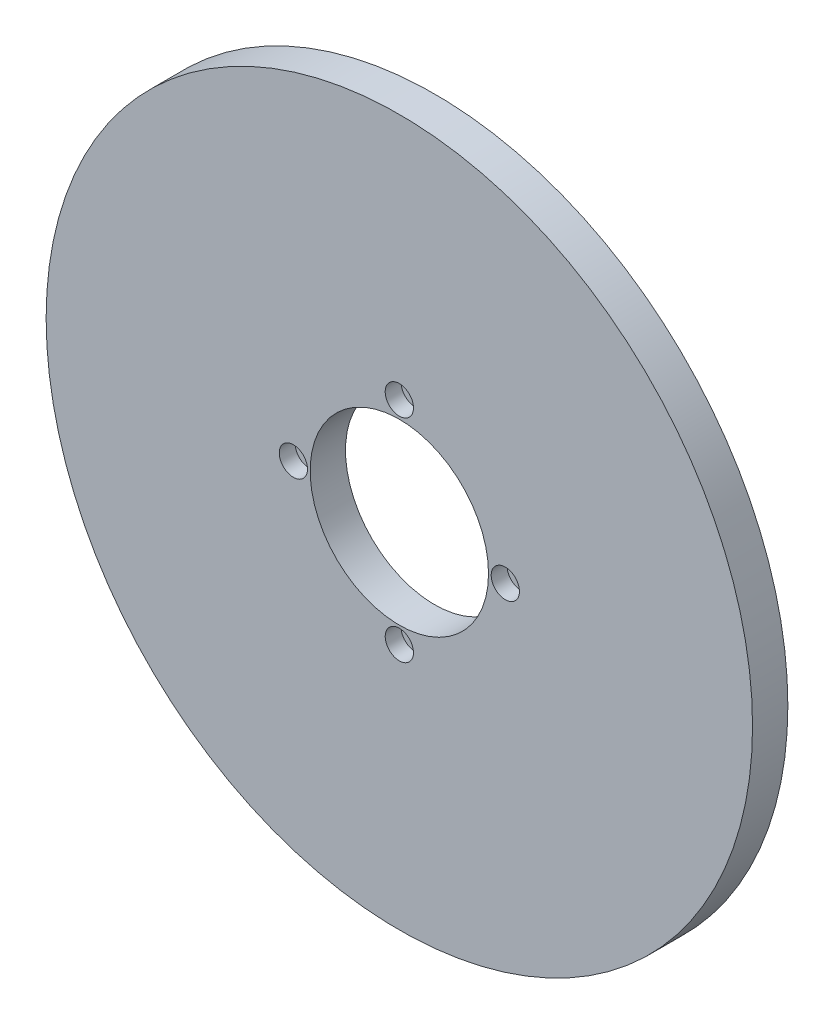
ISO-10303-21;
HEADER;
FILE_DESCRIPTION(('STEP AP214'),'2;1');
FILE_NAME('part.step','',(''),(''),'','','');
FILE_SCHEMA(('AUTOMOTIVE_DESIGN { 1 0 10303 214 1 1 1 1 }'));
ENDSEC;
DATA;
#1=APPLICATION_CONTEXT('core data for automotive mechanical design processes');
#2=APPLICATION_PROTOCOL_DEFINITION('international standard','automotive_design',2000,#1);
#3=PRODUCT_CONTEXT('',#1,'mechanical');
#4=PRODUCT('Part','Part','',(#3));
#5=PRODUCT_RELATED_PRODUCT_CATEGORY('part','',(#4));
#6=PRODUCT_DEFINITION_FORMATION('','',#4);
#7=PRODUCT_DEFINITION_CONTEXT('part definition',#1,'design');
#8=PRODUCT_DEFINITION('design','',#6,#7);
#9=PRODUCT_DEFINITION_SHAPE('','',#8);
#10=(LENGTH_UNIT() NAMED_UNIT(*) SI_UNIT(.MILLI.,.METRE.));
#11=(NAMED_UNIT(*) PLANE_ANGLE_UNIT() SI_UNIT($,.RADIAN.));
#12=(NAMED_UNIT(*) SI_UNIT($,.STERADIAN.) SOLID_ANGLE_UNIT());
#13=UNCERTAINTY_MEASURE_WITH_UNIT(LENGTH_MEASURE(1.E-05),#10,'distance_accuracy_value','');
#14=(GEOMETRIC_REPRESENTATION_CONTEXT(3) GLOBAL_UNCERTAINTY_ASSIGNED_CONTEXT((#13)) GLOBAL_UNIT_ASSIGNED_CONTEXT((#10,
#11,#12)) REPRESENTATION_CONTEXT('',''));
#15=CARTESIAN_POINT('',(0.,0.,0.));
#16=DIRECTION('',(0.,0.,1.));
#17=DIRECTION('',(1.,0.,0.));
#18=AXIS2_PLACEMENT_3D('',#15,#16,#17);
#19=CARTESIAN_POINT('',(0.,-29.9999999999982,10.));
#20=DIRECTION('',(0.,0.,-1.));
#21=DIRECTION('',(-1.,0.,0.));
#22=AXIS2_PLACEMENT_3D('',#19,#20,#21);
#23=CYLINDRICAL_SURFACE('',#22,2.25);
#24=CARTESIAN_POINT('',(0.,-29.9999999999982,0.));
#25=DIRECTION('',(0.,0.,1.));
#26=DIRECTION('',(1.,0.,0.));
#27=AXIS2_PLACEMENT_3D('',#24,#25,#26);
#28=CIRCLE('',#27,2.25);
#29=CARTESIAN_POINT('',(2.25,-29.9999999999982,0.));
#30=VERTEX_POINT('',#29);
#31=EDGE_CURVE('E52',#30,#30,#28,.T.);
#32=ORIENTED_EDGE('',*,*,#31,.F.);
#33=EDGE_LOOP('',(#32));
#34=FACE_BOUND('',#33,.T.);
#35=CARTESIAN_POINT('',(0.,-29.9999999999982,5.5));
#36=DIRECTION('',(0.,0.,1.));
#37=DIRECTION('',(1.,0.,0.));
#38=AXIS2_PLACEMENT_3D('',#35,#36,#37);
#39=CIRCLE('',#38,2.25);
#40=CARTESIAN_POINT('',(2.25,-29.9999999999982,5.5));
#41=VERTEX_POINT('',#40);
#42=EDGE_CURVE('E34',#41,#41,#39,.T.);
#43=ORIENTED_EDGE('',*,*,#42,.T.);
#44=EDGE_LOOP('',(#43));
#45=FACE_BOUND('',#44,.T.);
#46=ADVANCED_FACE('F30',(#34,#45),#23,.F.);
#47=CARTESIAN_POINT('',(-30.,-9.09494701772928E-13,10.));
#48=DIRECTION('',(0.,0.,-1.));
#49=DIRECTION('',(-1.,0.,0.));
#50=AXIS2_PLACEMENT_3D('',#47,#48,#49);
#51=CYLINDRICAL_SURFACE('',#50,2.25);
#52=CARTESIAN_POINT('',(-30.,-9.09494701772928E-13,0.));
#53=DIRECTION('',(0.,0.,1.));
#54=DIRECTION('',(1.,0.,0.));
#55=AXIS2_PLACEMENT_3D('',#52,#53,#54);
#56=CIRCLE('',#55,2.25);
#57=CARTESIAN_POINT('',(-27.75,-9.09494701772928E-13,0.));
#58=VERTEX_POINT('',#57);
#59=EDGE_CURVE('E85',#58,#58,#56,.T.);
#60=ORIENTED_EDGE('',*,*,#59,.F.);
#61=EDGE_LOOP('',(#60));
#62=FACE_BOUND('',#61,.T.);
#63=CARTESIAN_POINT('',(-30.,-9.09494701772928E-13,5.5));
#64=DIRECTION('',(0.,0.,1.));
#65=DIRECTION('',(1.,0.,0.));
#66=AXIS2_PLACEMENT_3D('',#63,#64,#65);
#67=CIRCLE('',#66,2.25);
#68=CARTESIAN_POINT('',(-27.75,-9.09494701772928E-13,5.5));
#69=VERTEX_POINT('',#68);
#70=EDGE_CURVE('E58',#69,#69,#67,.T.);
#71=ORIENTED_EDGE('',*,*,#70,.T.);
#72=EDGE_LOOP('',(#71));
#73=FACE_BOUND('',#72,.T.);
#74=ADVANCED_FACE('F117',(#62,#73),#51,.F.);
#75=CARTESIAN_POINT('',(0.,29.9999999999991,10.));
#76=DIRECTION('',(0.,0.,-1.));
#77=DIRECTION('',(-1.,0.,0.));
#78=AXIS2_PLACEMENT_3D('',#75,#76,#77);
#79=CYLINDRICAL_SURFACE('',#78,2.25);
#80=CARTESIAN_POINT('',(0.,29.9999999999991,0.));
#81=DIRECTION('',(0.,0.,1.));
#82=DIRECTION('',(1.,0.,0.));
#83=AXIS2_PLACEMENT_3D('',#80,#81,#82);
#84=CIRCLE('',#83,2.25);
#85=CARTESIAN_POINT('',(2.25,29.9999999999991,0.));
#86=VERTEX_POINT('',#85);
#87=EDGE_CURVE('E88',#86,#86,#84,.T.);
#88=ORIENTED_EDGE('',*,*,#87,.F.);
#89=EDGE_LOOP('',(#88));
#90=FACE_BOUND('',#89,.T.);
#91=CARTESIAN_POINT('',(0.,29.9999999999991,5.5));
#92=DIRECTION('',(0.,0.,1.));
#93=DIRECTION('',(1.,0.,0.));
#94=AXIS2_PLACEMENT_3D('',#91,#92,#93);
#95=CIRCLE('',#94,2.25);
#96=CARTESIAN_POINT('',(2.25,29.9999999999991,5.5));
#97=VERTEX_POINT('',#96);
#98=EDGE_CURVE('E54',#97,#97,#95,.T.);
#99=ORIENTED_EDGE('',*,*,#98,.T.);
#100=EDGE_LOOP('',(#99));
#101=FACE_BOUND('',#100,.T.);
#102=ADVANCED_FACE('F123',(#90,#101),#79,.F.);
#103=CARTESIAN_POINT('',(30.,-9.09494701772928E-13,10.));
#104=DIRECTION('',(0.,0.,-1.));
#105=DIRECTION('',(-1.,0.,0.));
#106=AXIS2_PLACEMENT_3D('',#103,#104,#105);
#107=CYLINDRICAL_SURFACE('',#106,2.25);
#108=CARTESIAN_POINT('',(30.,-9.09494701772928E-13,0.));
#109=DIRECTION('',(0.,0.,1.));
#110=DIRECTION('',(1.,0.,0.));
#111=AXIS2_PLACEMENT_3D('',#108,#109,#110);
#112=CIRCLE('',#111,2.25);
#113=CARTESIAN_POINT('',(32.25,-9.09494701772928E-13,0.));
#114=VERTEX_POINT('',#113);
#115=EDGE_CURVE('E91',#114,#114,#112,.T.);
#116=ORIENTED_EDGE('',*,*,#115,.F.);
#117=EDGE_LOOP('',(#116));
#118=FACE_BOUND('',#117,.T.);
#119=CARTESIAN_POINT('',(30.,-9.09494701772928E-13,5.5));
#120=DIRECTION('',(0.,0.,1.));
#121=DIRECTION('',(1.,0.,0.));
#122=AXIS2_PLACEMENT_3D('',#119,#120,#121);
#123=CIRCLE('',#122,2.25);
#124=CARTESIAN_POINT('',(32.25,-9.09494701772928E-13,5.5));
#125=VERTEX_POINT('',#124);
#126=EDGE_CURVE('E49',#125,#125,#123,.T.);
#127=ORIENTED_EDGE('',*,*,#126,.T.);
#128=EDGE_LOOP('',(#127));
#129=FACE_BOUND('',#128,.T.);
#130=ADVANCED_FACE('F131',(#118,#129),#107,.F.);
#131=CARTESIAN_POINT('',(0.,-9.09494701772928E-13,10.));
#132=DIRECTION('',(0.,0.,1.));
#133=DIRECTION('',(1.,0.,0.));
#134=AXIS2_PLACEMENT_3D('',#131,#132,#133);
#135=PLANE('',#134);
#136=CARTESIAN_POINT('',(0.,-29.9999999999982,10.));
#137=DIRECTION('',(0.,0.,1.));
#138=DIRECTION('',(1.,0.,0.));
#139=AXIS2_PLACEMENT_3D('',#136,#137,#138);
#140=CIRCLE('',#139,4.);
#141=CARTESIAN_POINT('',(4.,-29.9999999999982,10.));
#142=VERTEX_POINT('',#141);
#143=EDGE_CURVE('E74',#142,#142,#140,.T.);
#144=ORIENTED_EDGE('',*,*,#143,.F.);
#145=EDGE_LOOP('',(#144));
#146=FACE_BOUND('',#145,.T.);
#147=CARTESIAN_POINT('',(-30.,-9.09494701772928E-13,10.));
#148=DIRECTION('',(0.,0.,1.));
#149=DIRECTION('',(1.,0.,0.));
#150=AXIS2_PLACEMENT_3D('',#147,#148,#149);
#151=CIRCLE('',#150,4.);
#152=CARTESIAN_POINT('',(-26.,-9.09494701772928E-13,10.));
#153=VERTEX_POINT('',#152);
#154=EDGE_CURVE('E67',#153,#153,#151,.T.);
#155=ORIENTED_EDGE('',*,*,#154,.F.);
#156=EDGE_LOOP('',(#155));
#157=FACE_BOUND('',#156,.T.);
#158=CARTESIAN_POINT('',(0.,29.9999999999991,10.));
#159=DIRECTION('',(0.,0.,1.));
#160=DIRECTION('',(1.,0.,0.));
#161=AXIS2_PLACEMENT_3D('',#158,#159,#160);
#162=CIRCLE('',#161,4.);
#163=CARTESIAN_POINT('',(4.,29.9999999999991,10.));
#164=VERTEX_POINT('',#163);
#165=EDGE_CURVE('E60',#164,#164,#162,.T.);
#166=ORIENTED_EDGE('',*,*,#165,.F.);
#167=EDGE_LOOP('',(#166));
#168=FACE_BOUND('',#167,.T.);
#169=CARTESIAN_POINT('',(30.,-9.09494701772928E-13,10.));
#170=DIRECTION('',(0.,0.,1.));
#171=DIRECTION('',(1.,0.,0.));
#172=AXIS2_PLACEMENT_3D('',#169,#170,#171);
#173=CIRCLE('',#172,4.);
#174=CARTESIAN_POINT('',(34.,-9.09494701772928E-13,10.));
#175=VERTEX_POINT('',#174);
#176=EDGE_CURVE('E56',#175,#175,#173,.T.);
#177=ORIENTED_EDGE('',*,*,#176,.F.);
#178=EDGE_LOOP('',(#177));
#179=FACE_BOUND('',#178,.T.);
#180=CARTESIAN_POINT('',(0.,-9.09494701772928E-13,10.));
#181=DIRECTION('',(0.,0.,1.));
#182=DIRECTION('',(1.,0.,0.));
#183=AXIS2_PLACEMENT_3D('',#180,#181,#182);
#184=CIRCLE('',#183,100.);
#185=CARTESIAN_POINT('',(100.,-9.09494701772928E-13,10.));
#186=VERTEX_POINT('',#185);
#187=EDGE_CURVE('E10',#186,#186,#184,.T.);
#188=ORIENTED_EDGE('',*,*,#187,.T.);
#189=EDGE_LOOP('',(#188));
#190=FACE_BOUND('',#189,.T.);
#191=CARTESIAN_POINT('',(0.,-9.09494701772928E-13,10.));
#192=DIRECTION('',(0.,0.,1.));
#193=DIRECTION('',(1.,0.,0.));
#194=AXIS2_PLACEMENT_3D('',#191,#192,#193);
#195=CIRCLE('',#194,25.2499999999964);
#196=CARTESIAN_POINT('',(25.2499999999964,-9.09494701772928E-13,10.));
#197=VERTEX_POINT('',#196);
#198=EDGE_CURVE('E43',#197,#197,#195,.T.);
#199=ORIENTED_EDGE('',*,*,#198,.F.);
#200=EDGE_LOOP('',(#199));
#201=FACE_BOUND('',#200,.T.);
#202=ADVANCED_FACE('F134',(#146,#157,#168,#179,#190,#201),#135,.T.);
#203=CARTESIAN_POINT('',(0.,-9.09494701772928E-13,0.));
#204=DIRECTION('',(0.,0.,1.));
#205=DIRECTION('',(1.,0.,0.));
#206=AXIS2_PLACEMENT_3D('',#203,#204,#205);
#207=PLANE('',#206);
#208=ORIENTED_EDGE('',*,*,#59,.T.);
#209=EDGE_LOOP('',(#208));
#210=FACE_BOUND('',#209,.T.);
#211=ORIENTED_EDGE('',*,*,#115,.T.);
#212=EDGE_LOOP('',(#211));
#213=FACE_BOUND('',#212,.T.);
#214=CARTESIAN_POINT('',(0.,-9.09494701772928E-13,0.));
#215=DIRECTION('',(0.,0.,1.));
#216=DIRECTION('',(1.,0.,0.));
#217=AXIS2_PLACEMENT_3D('',#214,#215,#216);
#218=CIRCLE('',#217,100.);
#219=CARTESIAN_POINT('',(100.,-9.09494701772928E-13,0.));
#220=VERTEX_POINT('',#219);
#221=EDGE_CURVE('E38',#220,#220,#218,.T.);
#222=ORIENTED_EDGE('',*,*,#221,.F.);
#223=EDGE_LOOP('',(#222));
#224=FACE_BOUND('',#223,.T.);
#225=CARTESIAN_POINT('',(0.,-9.09494701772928E-13,0.));
#226=DIRECTION('',(0.,0.,1.));
#227=DIRECTION('',(1.,0.,0.));
#228=AXIS2_PLACEMENT_3D('',#225,#226,#227);
#229=CIRCLE('',#228,25.2499999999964);
#230=CARTESIAN_POINT('',(25.2499999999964,-9.09494701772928E-13,0.));
#231=VERTEX_POINT('',#230);
#232=EDGE_CURVE('E46',#231,#231,#229,.T.);
#233=ORIENTED_EDGE('',*,*,#232,.T.);
#234=EDGE_LOOP('',(#233));
#235=FACE_BOUND('',#234,.T.);
#236=ORIENTED_EDGE('',*,*,#87,.T.);
#237=EDGE_LOOP('',(#236));
#238=FACE_BOUND('',#237,.T.);
#239=ORIENTED_EDGE('',*,*,#31,.T.);
#240=EDGE_LOOP('',(#239));
#241=FACE_BOUND('',#240,.T.);
#242=ADVANCED_FACE('F99',(#210,#213,#224,#235,#238,#241),#207,.F.);
#243=CARTESIAN_POINT('',(0.,-9.09494701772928E-13,10.));
#244=DIRECTION('',(0.,0.,-1.));
#245=DIRECTION('',(-1.,0.,0.));
#246=AXIS2_PLACEMENT_3D('',#243,#244,#245);
#247=CYLINDRICAL_SURFACE('',#246,100.);
#248=ORIENTED_EDGE('',*,*,#187,.F.);
#249=EDGE_LOOP('',(#248));
#250=FACE_BOUND('',#249,.T.);
#251=ORIENTED_EDGE('',*,*,#221,.T.);
#252=EDGE_LOOP('',(#251));
#253=FACE_BOUND('',#252,.T.);
#254=ADVANCED_FACE('F32',(#250,#253),#247,.T.);
#255=CARTESIAN_POINT('',(0.,-9.09494701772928E-13,10.));
#256=DIRECTION('',(0.,0.,-1.));
#257=DIRECTION('',(-1.,0.,0.));
#258=AXIS2_PLACEMENT_3D('',#255,#256,#257);
#259=CYLINDRICAL_SURFACE('',#258,25.2499999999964);
#260=ORIENTED_EDGE('',*,*,#198,.T.);
#261=EDGE_LOOP('',(#260));
#262=FACE_BOUND('',#261,.T.);
#263=ORIENTED_EDGE('',*,*,#232,.F.);
#264=EDGE_LOOP('',(#263));
#265=FACE_BOUND('',#264,.T.);
#266=ADVANCED_FACE('F102',(#262,#265),#259,.F.);
#267=CARTESIAN_POINT('',(30.,-9.09494701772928E-13,5.5));
#268=DIRECTION('',(0.,0.,1.));
#269=DIRECTION('',(1.,0.,0.));
#270=AXIS2_PLACEMENT_3D('',#267,#268,#269);
#271=CYLINDRICAL_SURFACE('',#270,4.);
#272=CARTESIAN_POINT('',(30.,-9.09494701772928E-13,5.5));
#273=DIRECTION('',(0.,0.,1.));
#274=DIRECTION('',(1.,0.,0.));
#275=AXIS2_PLACEMENT_3D('',#272,#273,#274);
#276=CIRCLE('',#275,4.);
#277=CARTESIAN_POINT('',(34.,-9.09494701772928E-13,5.5));
#278=VERTEX_POINT('',#277);
#279=EDGE_CURVE('E53',#278,#278,#276,.T.);
#280=ORIENTED_EDGE('',*,*,#279,.F.);
#281=EDGE_LOOP('',(#280));
#282=FACE_BOUND('',#281,.T.);
#283=ORIENTED_EDGE('',*,*,#176,.T.);
#284=EDGE_LOOP('',(#283));
#285=FACE_BOUND('',#284,.T.);
#286=ADVANCED_FACE('F104',(#282,#285),#271,.F.);
#287=CARTESIAN_POINT('',(30.,-9.09494701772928E-13,5.5));
#288=DIRECTION('',(0.,0.,1.));
#289=DIRECTION('',(1.,0.,0.));
#290=AXIS2_PLACEMENT_3D('',#287,#288,#289);
#291=PLANE('',#290);
#292=ORIENTED_EDGE('',*,*,#126,.F.);
#293=EDGE_LOOP('',(#292));
#294=FACE_BOUND('',#293,.T.);
#295=ORIENTED_EDGE('',*,*,#279,.T.);
#296=EDGE_LOOP('',(#295));
#297=FACE_BOUND('',#296,.T.);
#298=ADVANCED_FACE('F110',(#294,#297),#291,.T.);
#299=CARTESIAN_POINT('',(0.,29.9999999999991,5.5));
#300=DIRECTION('',(0.,0.,1.));
#301=DIRECTION('',(1.,0.,0.));
#302=AXIS2_PLACEMENT_3D('',#299,#300,#301);
#303=CYLINDRICAL_SURFACE('',#302,4.);
#304=CARTESIAN_POINT('',(0.,29.9999999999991,5.5));
#305=DIRECTION('',(0.,0.,1.));
#306=DIRECTION('',(1.,0.,0.));
#307=AXIS2_PLACEMENT_3D('',#304,#305,#306);
#308=CIRCLE('',#307,4.);
#309=CARTESIAN_POINT('',(4.,29.9999999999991,5.5));
#310=VERTEX_POINT('',#309);
#311=EDGE_CURVE('E57',#310,#310,#308,.T.);
#312=ORIENTED_EDGE('',*,*,#311,.F.);
#313=EDGE_LOOP('',(#312));
#314=FACE_BOUND('',#313,.T.);
#315=ORIENTED_EDGE('',*,*,#165,.T.);
#316=EDGE_LOOP('',(#315));
#317=FACE_BOUND('',#316,.T.);
#318=ADVANCED_FACE('F146',(#314,#317),#303,.F.);
#319=CARTESIAN_POINT('',(0.,29.9999999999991,5.5));
#320=DIRECTION('',(0.,0.,1.));
#321=DIRECTION('',(1.,0.,0.));
#322=AXIS2_PLACEMENT_3D('',#319,#320,#321);
#323=PLANE('',#322);
#324=ORIENTED_EDGE('',*,*,#98,.F.);
#325=EDGE_LOOP('',(#324));
#326=FACE_BOUND('',#325,.T.);
#327=ORIENTED_EDGE('',*,*,#311,.T.);
#328=EDGE_LOOP('',(#327));
#329=FACE_BOUND('',#328,.T.);
#330=ADVANCED_FACE('F155',(#326,#329),#323,.T.);
#331=CARTESIAN_POINT('',(-30.,-9.09494701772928E-13,5.5));
#332=DIRECTION('',(0.,0.,1.));
#333=DIRECTION('',(1.,0.,0.));
#334=AXIS2_PLACEMENT_3D('',#331,#332,#333);
#335=CYLINDRICAL_SURFACE('',#334,4.);
#336=CARTESIAN_POINT('',(-30.,-9.09494701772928E-13,5.5));
#337=DIRECTION('',(0.,0.,1.));
#338=DIRECTION('',(1.,0.,0.));
#339=AXIS2_PLACEMENT_3D('',#336,#337,#338);
#340=CIRCLE('',#339,4.);
#341=CARTESIAN_POINT('',(-26.,-9.09494701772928E-13,5.5));
#342=VERTEX_POINT('',#341);
#343=EDGE_CURVE('E61',#342,#342,#340,.T.);
#344=ORIENTED_EDGE('',*,*,#343,.F.);
#345=EDGE_LOOP('',(#344));
#346=FACE_BOUND('',#345,.T.);
#347=ORIENTED_EDGE('',*,*,#154,.T.);
#348=EDGE_LOOP('',(#347));
#349=FACE_BOUND('',#348,.T.);
#350=ADVANCED_FACE('F161',(#346,#349),#335,.F.);
#351=CARTESIAN_POINT('',(-30.,-9.09494701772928E-13,5.5));
#352=DIRECTION('',(0.,0.,1.));
#353=DIRECTION('',(1.,0.,0.));
#354=AXIS2_PLACEMENT_3D('',#351,#352,#353);
#355=PLANE('',#354);
#356=ORIENTED_EDGE('',*,*,#70,.F.);
#357=EDGE_LOOP('',(#356));
#358=FACE_BOUND('',#357,.T.);
#359=ORIENTED_EDGE('',*,*,#343,.T.);
#360=EDGE_LOOP('',(#359));
#361=FACE_BOUND('',#360,.T.);
#362=ADVANCED_FACE('F165',(#358,#361),#355,.T.);
#363=CARTESIAN_POINT('',(0.,-29.9999999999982,5.5));
#364=DIRECTION('',(0.,0.,1.));
#365=DIRECTION('',(1.,0.,0.));
#366=AXIS2_PLACEMENT_3D('',#363,#364,#365);
#367=CYLINDRICAL_SURFACE('',#366,4.);
#368=CARTESIAN_POINT('',(0.,-29.9999999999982,5.5));
#369=DIRECTION('',(0.,0.,1.));
#370=DIRECTION('',(1.,0.,0.));
#371=AXIS2_PLACEMENT_3D('',#368,#369,#370);
#372=CIRCLE('',#371,4.);
#373=CARTESIAN_POINT('',(4.,-29.9999999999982,5.5));
#374=VERTEX_POINT('',#373);
#375=EDGE_CURVE('E184',#374,#374,#372,.T.);
#376=ORIENTED_EDGE('',*,*,#375,.F.);
#377=EDGE_LOOP('',(#376));
#378=FACE_BOUND('',#377,.T.);
#379=ORIENTED_EDGE('',*,*,#143,.T.);
#380=EDGE_LOOP('',(#379));
#381=FACE_BOUND('',#380,.T.);
#382=ADVANCED_FACE('F169',(#378,#381),#367,.F.);
#383=CARTESIAN_POINT('',(0.,-29.9999999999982,5.5));
#384=DIRECTION('',(0.,0.,1.));
#385=DIRECTION('',(1.,0.,0.));
#386=AXIS2_PLACEMENT_3D('',#383,#384,#385);
#387=PLANE('',#386);
#388=ORIENTED_EDGE('',*,*,#42,.F.);
#389=EDGE_LOOP('',(#388));
#390=FACE_BOUND('',#389,.T.);
#391=ORIENTED_EDGE('',*,*,#375,.T.);
#392=EDGE_LOOP('',(#391));
#393=FACE_BOUND('',#392,.T.);
#394=ADVANCED_FACE('F173',(#390,#393),#387,.T.);
#395=CLOSED_SHELL('',(#46,#74,#102,#130,#202,#242,#254,#266,#286,#298,#318,#330,#350,#362,#382,#394));
#396=MANIFOLD_SOLID_BREP('B2',#395);
#397=ADVANCED_BREP_SHAPE_REPRESENTATION('',(#18,#396),#14);
#398=SHAPE_DEFINITION_REPRESENTATION(#9,#397);
ENDSEC;
END-ISO-10303-21;
